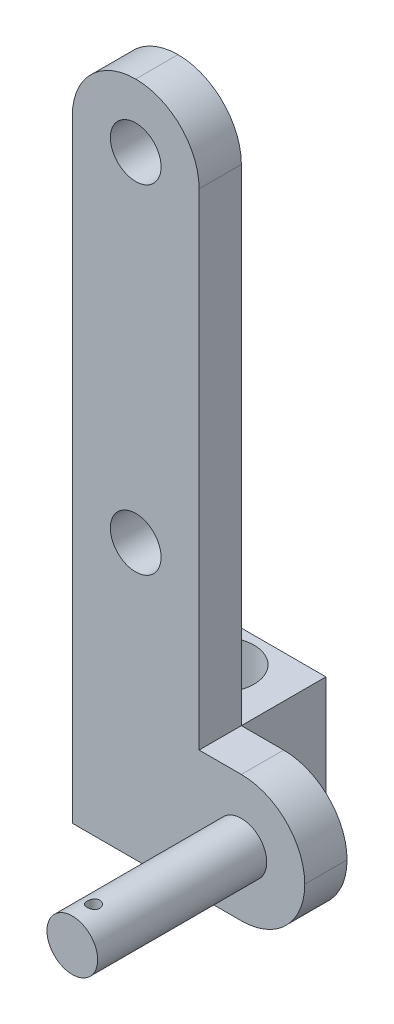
ISO-10303-21;
HEADER;
FILE_DESCRIPTION(('STEP AP214'),'2;1');
FILE_NAME('part.step','',(''),(''),'','','');
FILE_SCHEMA(('AUTOMOTIVE_DESIGN { 1 0 10303 214 1 1 1 1 }'));
ENDSEC;
DATA;
#1=APPLICATION_CONTEXT('core data for automotive mechanical design processes');
#2=APPLICATION_PROTOCOL_DEFINITION('international standard','automotive_design',2000,#1);
#3=PRODUCT_CONTEXT('',#1,'mechanical');
#4=PRODUCT('Part','Part','',(#3));
#5=PRODUCT_RELATED_PRODUCT_CATEGORY('part','',(#4));
#6=PRODUCT_DEFINITION_FORMATION('','',#4);
#7=PRODUCT_DEFINITION_CONTEXT('part definition',#1,'design');
#8=PRODUCT_DEFINITION('design','',#6,#7);
#9=PRODUCT_DEFINITION_SHAPE('','',#8);
#10=(LENGTH_UNIT() NAMED_UNIT(*) SI_UNIT(.MILLI.,.METRE.));
#11=(NAMED_UNIT(*) PLANE_ANGLE_UNIT() SI_UNIT($,.RADIAN.));
#12=(NAMED_UNIT(*) SI_UNIT($,.STERADIAN.) SOLID_ANGLE_UNIT());
#13=UNCERTAINTY_MEASURE_WITH_UNIT(LENGTH_MEASURE(1.E-05),#10,'distance_accuracy_value','');
#14=(GEOMETRIC_REPRESENTATION_CONTEXT(3) GLOBAL_UNCERTAINTY_ASSIGNED_CONTEXT((#13)) GLOBAL_UNIT_ASSIGNED_CONTEXT((#10,
#11,#12)) REPRESENTATION_CONTEXT('',''));
#15=CARTESIAN_POINT('',(0.,0.,0.));
#16=DIRECTION('',(0.,0.,1.));
#17=DIRECTION('',(1.,0.,0.));
#18=AXIS2_PLACEMENT_3D('',#15,#16,#17);
#19=CARTESIAN_POINT('',(-30.,0.,0.));
#20=DIRECTION('',(0.,0.,-1.));
#21=DIRECTION('',(-1.,0.,0.));
#22=AXIS2_PLACEMENT_3D('',#19,#20,#21);
#23=PLANE('',#22);
#24=CARTESIAN_POINT('',(-15.,-95.,0.));
#25=DIRECTION('',(0.,0.,-1.));
#26=DIRECTION('',(-1.,0.,0.));
#27=AXIS2_PLACEMENT_3D('',#24,#25,#26);
#28=CIRCLE('',#27,6.);
#29=CARTESIAN_POINT('',(-21.,-95.,0.));
#30=VERTEX_POINT('',#29);
#31=EDGE_CURVE('E326',#30,#30,#28,.T.);
#32=ORIENTED_EDGE('',*,*,#31,.F.);
#33=EDGE_LOOP('',(#32));
#34=FACE_BOUND('',#33,.T.);
#35=CARTESIAN_POINT('',(-15.,-15.,0.));
#36=DIRECTION('',(0.,0.,-1.));
#37=DIRECTION('',(-1.,0.,0.));
#38=AXIS2_PLACEMENT_3D('',#35,#36,#37);
#39=CIRCLE('',#38,6.);
#40=CARTESIAN_POINT('',(-21.,-15.,0.));
#41=VERTEX_POINT('',#40);
#42=EDGE_CURVE('E320',#41,#41,#39,.T.);
#43=ORIENTED_EDGE('',*,*,#42,.F.);
#44=EDGE_LOOP('',(#43));
#45=FACE_BOUND('',#44,.T.);
#46=DIRECTION('',(0.,-1.,0.));
#47=VECTOR('',#46,1.);
#48=CARTESIAN_POINT('',(-30.,0.,0.));
#49=LINE('',#48,#47);
#50=CARTESIAN_POINT('',(-30.,-15.,0.));
#51=VERTEX_POINT('',#50);
#52=CARTESIAN_POINT('',(-30.,-130.,0.));
#53=VERTEX_POINT('',#52);
#54=EDGE_CURVE('E146',#51,#53,#49,.T.);
#55=ORIENTED_EDGE('',*,*,#54,.F.);
#56=CARTESIAN_POINT('',(-15.,-15.,0.));
#57=DIRECTION('',(0.,0.,-1.));
#58=DIRECTION('',(-1.,0.,0.));
#59=AXIS2_PLACEMENT_3D('',#56,#57,#58);
#60=CIRCLE('',#59,15.);
#61=CARTESIAN_POINT('',(-15.,0.,0.));
#62=VERTEX_POINT('',#61);
#63=EDGE_CURVE('E46',#51,#62,#60,.T.);
#64=ORIENTED_EDGE('',*,*,#63,.T.);
#65=CARTESIAN_POINT('',(-15.,-15.,0.));
#66=DIRECTION('',(0.,0.,-1.));
#67=DIRECTION('',(-1.,0.,0.));
#68=AXIS2_PLACEMENT_3D('',#65,#66,#67);
#69=CIRCLE('',#68,15.);
#70=CARTESIAN_POINT('',(0.,-15.,0.));
#71=VERTEX_POINT('',#70);
#72=EDGE_CURVE('E54',#62,#71,#69,.T.);
#73=ORIENTED_EDGE('',*,*,#72,.T.);
#74=DIRECTION('',(0.,1.,0.));
#75=VECTOR('',#74,1.);
#76=CARTESIAN_POINT('',(0.,0.,0.));
#77=LINE('',#76,#75);
#78=CARTESIAN_POINT('',(0.,-130.,0.));
#79=VERTEX_POINT('',#78);
#80=EDGE_CURVE('E157',#79,#71,#77,.T.);
#81=ORIENTED_EDGE('',*,*,#80,.F.);
#82=DIRECTION('',(1.,0.,0.));
#83=VECTOR('',#82,1.);
#84=CARTESIAN_POINT('',(-30.,-130.,0.));
#85=LINE('',#84,#83);
#86=EDGE_CURVE('E142',#53,#79,#85,.T.);
#87=ORIENTED_EDGE('',*,*,#86,.F.);
#88=EDGE_LOOP('',(#55,#64,#73,#81,#87));
#89=FACE_BOUND('',#88,.T.);
#90=ADVANCED_FACE('F33',(#34,#45,#89),#23,.T.);
#91=CARTESIAN_POINT('',(-30.,0.,10.));
#92=DIRECTION('',(0.,0.,-1.));
#93=DIRECTION('',(-1.,0.,0.));
#94=AXIS2_PLACEMENT_3D('',#91,#92,#93);
#95=PLANE('',#94);
#96=CARTESIAN_POINT('',(-15.,-95.,10.));
#97=DIRECTION('',(0.,0.,1.));
#98=DIRECTION('',(1.,0.,0.));
#99=AXIS2_PLACEMENT_3D('',#96,#97,#98);
#100=CIRCLE('',#99,6.);
#101=CARTESIAN_POINT('',(-8.99999999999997,-95.,10.));
#102=VERTEX_POINT('',#101);
#103=EDGE_CURVE('E184',#102,#102,#100,.T.);
#104=ORIENTED_EDGE('',*,*,#103,.F.);
#105=EDGE_LOOP('',(#104));
#106=FACE_BOUND('',#105,.T.);
#107=CARTESIAN_POINT('',(-15.,-15.,10.));
#108=DIRECTION('',(0.,0.,1.));
#109=DIRECTION('',(1.,0.,0.));
#110=AXIS2_PLACEMENT_3D('',#107,#108,#109);
#111=CIRCLE('',#110,6.);
#112=CARTESIAN_POINT('',(-8.99999999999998,-15.,10.));
#113=VERTEX_POINT('',#112);
#114=EDGE_CURVE('E323',#113,#113,#111,.T.);
#115=ORIENTED_EDGE('',*,*,#114,.F.);
#116=EDGE_LOOP('',(#115));
#117=FACE_BOUND('',#116,.T.);
#118=DIRECTION('',(1.,0.,0.));
#119=VECTOR('',#118,1.);
#120=CARTESIAN_POINT('',(25.,-160.,10.));
#121=LINE('',#120,#119);
#122=CARTESIAN_POINT('',(-30.,-160.,10.));
#123=VERTEX_POINT('',#122);
#124=CARTESIAN_POINT('',(10.,-160.,10.));
#125=VERTEX_POINT('',#124);
#126=EDGE_CURVE('E156',#123,#125,#121,.T.);
#127=ORIENTED_EDGE('',*,*,#126,.T.);
#128=CARTESIAN_POINT('',(10.,-145.,10.));
#129=DIRECTION('',(0.,0.,-1.));
#130=DIRECTION('',(-1.,0.,0.));
#131=AXIS2_PLACEMENT_3D('',#128,#129,#130);
#132=CIRCLE('',#131,15.);
#133=CARTESIAN_POINT('',(25.,-145.,10.));
#134=VERTEX_POINT('',#133);
#135=EDGE_CURVE('E277',#125,#134,#132,.F.);
#136=ORIENTED_EDGE('',*,*,#135,.T.);
#137=CARTESIAN_POINT('',(10.,-145.,10.));
#138=DIRECTION('',(0.,0.,-1.));
#139=DIRECTION('',(-1.,0.,0.));
#140=AXIS2_PLACEMENT_3D('',#137,#138,#139);
#141=CIRCLE('',#140,15.);
#142=CARTESIAN_POINT('',(10.,-130.,10.));
#143=VERTEX_POINT('',#142);
#144=EDGE_CURVE('E263',#134,#143,#141,.F.);
#145=ORIENTED_EDGE('',*,*,#144,.T.);
#146=DIRECTION('',(-1.,0.,0.));
#147=VECTOR('',#146,1.);
#148=CARTESIAN_POINT('',(0.,-130.,10.));
#149=LINE('',#148,#147);
#150=CARTESIAN_POINT('',(0.,-130.,10.));
#151=VERTEX_POINT('',#150);
#152=EDGE_CURVE('E160',#143,#151,#149,.T.);
#153=ORIENTED_EDGE('',*,*,#152,.T.);
#154=DIRECTION('',(0.,1.,0.));
#155=VECTOR('',#154,1.);
#156=CARTESIAN_POINT('',(0.,0.,10.));
#157=LINE('',#156,#155);
#158=CARTESIAN_POINT('',(0.,-15.,10.));
#159=VERTEX_POINT('',#158);
#160=EDGE_CURVE('E162',#151,#159,#157,.T.);
#161=ORIENTED_EDGE('',*,*,#160,.T.);
#162=CARTESIAN_POINT('',(-15.,-15.,10.));
#163=DIRECTION('',(0.,0.,-1.));
#164=DIRECTION('',(-1.,0.,0.));
#165=AXIS2_PLACEMENT_3D('',#162,#163,#164);
#166=CIRCLE('',#165,15.);
#167=CARTESIAN_POINT('',(-15.,0.,10.));
#168=VERTEX_POINT('',#167);
#169=EDGE_CURVE('E270',#159,#168,#166,.F.);
#170=ORIENTED_EDGE('',*,*,#169,.T.);
#171=CARTESIAN_POINT('',(-15.,-15.,10.));
#172=DIRECTION('',(0.,0.,-1.));
#173=DIRECTION('',(-1.,0.,0.));
#174=AXIS2_PLACEMENT_3D('',#171,#172,#173);
#175=CIRCLE('',#174,15.);
#176=CARTESIAN_POINT('',(-30.,-15.,10.));
#177=VERTEX_POINT('',#176);
#178=EDGE_CURVE('E275',#168,#177,#175,.F.);
#179=ORIENTED_EDGE('',*,*,#178,.T.);
#180=DIRECTION('',(0.,-1.,0.));
#181=VECTOR('',#180,1.);
#182=CARTESIAN_POINT('',(-30.,0.,10.));
#183=LINE('',#182,#181);
#184=EDGE_CURVE('E154',#177,#123,#183,.T.);
#185=ORIENTED_EDGE('',*,*,#184,.T.);
#186=EDGE_LOOP('',(#127,#136,#145,#153,#161,#170,#179,#185));
#187=FACE_BOUND('',#186,.T.);
#188=CARTESIAN_POINT('',(10.,-145.,10.));
#189=DIRECTION('',(0.,0.,-1.));
#190=DIRECTION('',(-1.,0.,0.));
#191=AXIS2_PLACEMENT_3D('',#188,#189,#190);
#192=CIRCLE('',#191,6.);
#193=CARTESIAN_POINT('',(4.00000000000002,-145.,10.));
#194=VERTEX_POINT('',#193);
#195=EDGE_CURVE('E260',#194,#194,#192,.F.);
#196=ORIENTED_EDGE('',*,*,#195,.F.);
#197=EDGE_LOOP('',(#196));
#198=FACE_BOUND('',#197,.T.);
#199=ADVANCED_FACE('F230',(#106,#117,#187,#198),#95,.F.);
#200=CARTESIAN_POINT('',(-30.,0.,10.));
#201=DIRECTION('',(1.,0.,0.));
#202=DIRECTION('',(0.,1.,0.));
#203=AXIS2_PLACEMENT_3D('',#200,#201,#202);
#204=PLANE('',#203);
#205=ORIENTED_EDGE('',*,*,#184,.F.);
#206=DIRECTION('',(0.,0.,-1.));
#207=VECTOR('',#206,1.);
#208=CARTESIAN_POINT('',(-30.,-15.,10.));
#209=LINE('',#208,#207);
#210=EDGE_CURVE('E176',#177,#51,#209,.T.);
#211=ORIENTED_EDGE('',*,*,#210,.T.);
#212=ORIENTED_EDGE('',*,*,#54,.T.);
#213=DIRECTION('',(0.,0.,1.));
#214=VECTOR('',#213,1.);
#215=CARTESIAN_POINT('',(-30.,-130.,-20.));
#216=LINE('',#215,#214);
#217=CARTESIAN_POINT('',(-30.,-130.,-20.));
#218=VERTEX_POINT('',#217);
#219=EDGE_CURVE('E148',#218,#53,#216,.T.);
#220=ORIENTED_EDGE('',*,*,#219,.F.);
#221=DIRECTION('',(0.,1.,0.));
#222=VECTOR('',#221,1.);
#223=CARTESIAN_POINT('',(-30.,-160.,-20.));
#224=LINE('',#223,#222);
#225=CARTESIAN_POINT('',(-30.,-160.,-20.));
#226=VERTEX_POINT('',#225);
#227=EDGE_CURVE('E134',#226,#218,#224,.T.);
#228=ORIENTED_EDGE('',*,*,#227,.F.);
#229=DIRECTION('',(0.,0.,-1.));
#230=VECTOR('',#229,1.);
#231=CARTESIAN_POINT('',(-30.,-160.,10.));
#232=LINE('',#231,#230);
#233=EDGE_CURVE('E296',#123,#226,#232,.T.);
#234=ORIENTED_EDGE('',*,*,#233,.F.);
#235=EDGE_LOOP('',(#205,#211,#212,#220,#228,#234));
#236=FACE_BOUND('',#235,.T.);
#237=ADVANCED_FACE('F236',(#236),#204,.F.);
#238=CARTESIAN_POINT('',(25.,-160.,10.));
#239=DIRECTION('',(0.,1.,0.));
#240=DIRECTION('',(0.,0.,1.));
#241=AXIS2_PLACEMENT_3D('',#238,#239,#240);
#242=PLANE('',#241);
#243=CARTESIAN_POINT('',(-15.,-160.,-10.));
#244=DIRECTION('',(0.,1.,0.));
#245=DIRECTION('',(0.,0.,1.));
#246=AXIS2_PLACEMENT_3D('',#243,#244,#245);
#247=CIRCLE('',#246,8.);
#248=CARTESIAN_POINT('',(-15.,-160.,-2.));
#249=VERTEX_POINT('',#248);
#250=EDGE_CURVE('E309',#249,#249,#247,.T.);
#251=ORIENTED_EDGE('',*,*,#250,.T.);
#252=EDGE_LOOP('',(#251));
#253=FACE_BOUND('',#252,.T.);
#254=DIRECTION('',(1.,0.,0.));
#255=VECTOR('',#254,1.);
#256=CARTESIAN_POINT('',(25.,-160.,0.));
#257=LINE('',#256,#255);
#258=CARTESIAN_POINT('',(0.,-160.,0.));
#259=VERTEX_POINT('',#258);
#260=CARTESIAN_POINT('',(10.,-160.,0.));
#261=VERTEX_POINT('',#260);
#262=EDGE_CURVE('E173',#259,#261,#257,.T.);
#263=ORIENTED_EDGE('',*,*,#262,.T.);
#264=DIRECTION('',(0.,0.,-1.));
#265=VECTOR('',#264,1.);
#266=CARTESIAN_POINT('',(10.,-160.,10.));
#267=LINE('',#266,#265);
#268=EDGE_CURVE('E268',#261,#125,#267,.F.);
#269=ORIENTED_EDGE('',*,*,#268,.T.);
#270=ORIENTED_EDGE('',*,*,#126,.F.);
#271=ORIENTED_EDGE('',*,*,#233,.T.);
#272=DIRECTION('',(-1.,0.,0.));
#273=VECTOR('',#272,1.);
#274=CARTESIAN_POINT('',(0.,-160.,-20.));
#275=LINE('',#274,#273);
#276=CARTESIAN_POINT('',(0.,-160.,-20.));
#277=VERTEX_POINT('',#276);
#278=EDGE_CURVE('E128',#277,#226,#275,.T.);
#279=ORIENTED_EDGE('',*,*,#278,.F.);
#280=DIRECTION('',(0.,0.,1.));
#281=VECTOR('',#280,1.);
#282=CARTESIAN_POINT('',(0.,-160.,-20.));
#283=LINE('',#282,#281);
#284=EDGE_CURVE('E124',#277,#259,#283,.T.);
#285=ORIENTED_EDGE('',*,*,#284,.T.);
#286=EDGE_LOOP('',(#263,#269,#270,#271,#279,#285));
#287=FACE_BOUND('',#286,.T.);
#288=ADVANCED_FACE('F340',(#253,#287),#242,.F.);
#289=CARTESIAN_POINT('',(0.,-130.,10.));
#290=DIRECTION('',(0.,-1.,0.));
#291=DIRECTION('',(0.,0.,-1.));
#292=AXIS2_PLACEMENT_3D('',#289,#290,#291);
#293=PLANE('',#292);
#294=ORIENTED_EDGE('',*,*,#152,.F.);
#295=DIRECTION('',(0.,0.,-1.));
#296=VECTOR('',#295,1.);
#297=CARTESIAN_POINT('',(10.,-130.,10.));
#298=LINE('',#297,#296);
#299=CARTESIAN_POINT('',(10.,-130.,0.));
#300=VERTEX_POINT('',#299);
#301=EDGE_CURVE('E174',#143,#300,#298,.T.);
#302=ORIENTED_EDGE('',*,*,#301,.T.);
#303=DIRECTION('',(-1.,0.,0.));
#304=VECTOR('',#303,1.);
#305=CARTESIAN_POINT('',(0.,-130.,0.));
#306=LINE('',#305,#304);
#307=EDGE_CURVE('E257',#300,#79,#306,.T.);
#308=ORIENTED_EDGE('',*,*,#307,.T.);
#309=DIRECTION('',(0.,0.,-1.));
#310=VECTOR('',#309,1.);
#311=CARTESIAN_POINT('',(0.,-130.,10.));
#312=LINE('',#311,#310);
#313=EDGE_CURVE('E165',#151,#79,#312,.T.);
#314=ORIENTED_EDGE('',*,*,#313,.F.);
#315=EDGE_LOOP('',(#294,#302,#308,#314));
#316=FACE_BOUND('',#315,.T.);
#317=ADVANCED_FACE('F247',(#316),#293,.F.);
#318=CARTESIAN_POINT('',(0.,0.,10.));
#319=DIRECTION('',(-1.,0.,0.));
#320=DIRECTION('',(0.,-1.,0.));
#321=AXIS2_PLACEMENT_3D('',#318,#319,#320);
#322=PLANE('',#321);
#323=ORIENTED_EDGE('',*,*,#80,.T.);
#324=DIRECTION('',(0.,0.,-1.));
#325=VECTOR('',#324,1.);
#326=CARTESIAN_POINT('',(0.,-15.,10.));
#327=LINE('',#326,#325);
#328=EDGE_CURVE('E11',#71,#159,#327,.F.);
#329=ORIENTED_EDGE('',*,*,#328,.T.);
#330=ORIENTED_EDGE('',*,*,#160,.F.);
#331=ORIENTED_EDGE('',*,*,#313,.T.);
#332=EDGE_LOOP('',(#323,#329,#330,#331));
#333=FACE_BOUND('',#332,.T.);
#334=ADVANCED_FACE('F242',(#333),#322,.F.);
#335=CARTESIAN_POINT('',(10.,-145.,0.));
#336=DIRECTION('',(0.,0.,-1.));
#337=DIRECTION('',(-1.,0.,0.));
#338=AXIS2_PLACEMENT_3D('',#335,#336,#337);
#339=CIRCLE('',#338,15.);
#340=CARTESIAN_POINT('',(25.,-145.,0.));
#341=VERTEX_POINT('',#340);
#342=EDGE_CURVE('E251',#300,#341,#339,.T.);
#343=ORIENTED_EDGE('',*,*,#342,.T.);
#344=CARTESIAN_POINT('',(10.,-145.,0.));
#345=DIRECTION('',(0.,0.,-1.));
#346=DIRECTION('',(-1.,0.,0.));
#347=AXIS2_PLACEMENT_3D('',#344,#345,#346);
#348=CIRCLE('',#347,15.);
#349=EDGE_CURVE('E254',#341,#261,#348,.T.);
#350=ORIENTED_EDGE('',*,*,#349,.T.);
#351=ORIENTED_EDGE('',*,*,#262,.F.);
#352=DIRECTION('',(0.,-1.,0.));
#353=VECTOR('',#352,1.);
#354=CARTESIAN_POINT('',(0.,-130.,0.));
#355=LINE('',#354,#353);
#356=EDGE_CURVE('E138',#79,#259,#355,.T.);
#357=ORIENTED_EDGE('',*,*,#356,.F.);
#358=ORIENTED_EDGE('',*,*,#307,.F.);
#359=EDGE_LOOP('',(#343,#350,#351,#357,#358));
#360=FACE_BOUND('',#359,.T.);
#361=ADVANCED_FACE('F227',(#360),#23,.T.);
#362=CARTESIAN_POINT('',(10.,-145.,50.));
#363=DIRECTION('',(0.,0.,-1.));
#364=DIRECTION('',(-1.,0.,0.));
#365=AXIS2_PLACEMENT_3D('',#362,#363,#364);
#366=CYLINDRICAL_SURFACE('',#365,6.);
#367=CARTESIAN_POINT('',(10.,-151.,46.5));
#368=CARTESIAN_POINT('',(10.0828760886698,-150.99999859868,46.4999976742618));
#369=CARTESIAN_POINT('',(10.1657781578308,-150.998265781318,46.4931084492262));
#370=CARTESIAN_POINT('',(10.3292063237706,-150.991521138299,46.465774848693));
#371=CARTESIAN_POINT('',(10.4097310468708,-150.9865074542,46.4453227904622));
#372=CARTESIAN_POINT('',(10.5660208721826,-150.97375626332,46.3915607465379));
#373=CARTESIAN_POINT('',(10.64179156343,-150.966022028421,46.3582662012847));
#374=CARTESIAN_POINT('',(10.7866721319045,-150.948653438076,46.2798186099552));
#375=CARTESIAN_POINT('',(10.8557817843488,-150.939019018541,46.2346651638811));
#376=CARTESIAN_POINT('',(10.9868019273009,-150.918674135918,46.1327992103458));
#377=CARTESIAN_POINT('',(11.0485556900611,-150.907947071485,46.0758884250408));
#378=CARTESIAN_POINT('',(11.1617489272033,-150.886736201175,45.9525477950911));
#379=CARTESIAN_POINT('',(11.2131872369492,-150.876252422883,45.8861168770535));
#380=CARTESIAN_POINT('',(11.3050265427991,-150.856547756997,45.7444047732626));
#381=CARTESIAN_POINT('',(11.3452522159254,-150.847347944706,45.6690067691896));
#382=CARTESIAN_POINT('',(11.4123969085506,-150.831494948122,45.5122515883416));
#383=CARTESIAN_POINT('',(11.4393180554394,-150.824841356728,45.4308953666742));
#384=CARTESIAN_POINT('',(11.4785548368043,-150.815004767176,45.2662565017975));
#385=CARTESIAN_POINT('',(11.4911522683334,-150.811754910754,45.1830451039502));
#386=CARTESIAN_POINT('',(11.5022617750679,-150.808893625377,45.015631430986));
#387=CARTESIAN_POINT('',(11.500776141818,-150.809281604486,44.9314293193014));
#388=CARTESIAN_POINT('',(11.4839865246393,-150.813592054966,44.7665841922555));
#389=CARTESIAN_POINT('',(11.4690183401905,-150.817428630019,44.6859043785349));
#390=CARTESIAN_POINT('',(11.4262241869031,-150.828067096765,44.5282389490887));
#391=CARTESIAN_POINT('',(11.3983973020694,-150.834869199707,44.451253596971));
#392=CARTESIAN_POINT('',(11.3303894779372,-150.850751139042,44.3022619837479));
#393=CARTESIAN_POINT('',(11.2900866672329,-150.859853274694,44.2303138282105));
#394=CARTESIAN_POINT('',(11.198356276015,-150.879297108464,44.0940812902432));
#395=CARTESIAN_POINT('',(11.1469267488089,-150.889639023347,44.0297982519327));
#396=CARTESIAN_POINT('',(11.0326634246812,-150.910758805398,43.9087963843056));
#397=CARTESIAN_POINT('',(10.9695462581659,-150.92154069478,43.8523455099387));
#398=CARTESIAN_POINT('',(10.8346119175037,-150.942059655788,43.7507787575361));
#399=CARTESIAN_POINT('',(10.762794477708,-150.951796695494,43.7056632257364));
#400=CARTESIAN_POINT('',(10.6121158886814,-150.969177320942,43.6279494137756));
#401=CARTESIAN_POINT('',(10.5332313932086,-150.976813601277,43.5953946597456));
#402=CARTESIAN_POINT('',(10.3708760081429,-150.989079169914,43.5440826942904));
#403=CARTESIAN_POINT('',(10.2874059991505,-150.993709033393,43.5253228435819));
#404=CARTESIAN_POINT('',(10.12053997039,-150.999354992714,43.5025424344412));
#405=CARTESIAN_POINT('',(10.0371967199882,-151.000460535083,43.4981569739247));
#406=CARTESIAN_POINT('',(9.87096712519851,-150.999188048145,43.5032490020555));
#407=CARTESIAN_POINT('',(9.78808074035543,-150.996810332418,43.5127252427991));
#408=CARTESIAN_POINT('',(9.62638573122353,-150.988895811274,43.5449709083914));
#409=CARTESIAN_POINT('',(9.54753488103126,-150.983406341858,43.567541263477));
#410=CARTESIAN_POINT('',(9.39474270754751,-150.969887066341,43.6251070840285));
#411=CARTESIAN_POINT('',(9.32080188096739,-150.961857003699,43.6601038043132));
#412=CARTESIAN_POINT('',(9.17847686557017,-150.943933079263,43.7422361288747));
#413=CARTESIAN_POINT('',(9.11021455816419,-150.934008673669,43.7895761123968));
#414=CARTESIAN_POINT('',(8.98247338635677,-150.913445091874,43.894789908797));
#415=CARTESIAN_POINT('',(8.92299604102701,-150.902805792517,43.9526655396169));
#416=CARTESIAN_POINT('',(8.81300943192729,-150.881689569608,44.0790019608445));
#417=CARTESIAN_POINT('',(8.76275613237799,-150.871223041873,44.1476877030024));
#418=CARTESIAN_POINT('',(8.67448924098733,-150.851928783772,44.2927326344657));
#419=CARTESIAN_POINT('',(8.63647510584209,-150.84310098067,44.3690914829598));
#420=CARTESIAN_POINT('',(8.57404857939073,-150.828180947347,44.5269057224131));
#421=CARTESIAN_POINT('',(8.54955560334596,-150.822072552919,44.608327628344));
#422=CARTESIAN_POINT('',(8.51465434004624,-150.813267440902,44.7743096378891));
#423=CARTESIAN_POINT('',(8.50424297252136,-150.810569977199,44.8588690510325));
#424=CARTESIAN_POINT('',(8.49796140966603,-150.80894901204,45.0261210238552));
#425=CARTESIAN_POINT('',(8.5016821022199,-150.809919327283,45.1087974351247));
#426=CARTESIAN_POINT('',(8.52262272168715,-150.815279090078,45.272303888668));
#427=CARTESIAN_POINT('',(8.53984237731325,-150.819668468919,45.3531339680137));
#428=CARTESIAN_POINT('',(8.58706868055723,-150.831312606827,45.5102084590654));
#429=CARTESIAN_POINT('',(8.61699859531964,-150.838550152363,45.5864773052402));
#430=CARTESIAN_POINT('',(8.68873508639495,-150.855077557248,45.7329653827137));
#431=CARTESIAN_POINT('',(8.73054330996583,-150.864367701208,45.8031837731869));
#432=CARTESIAN_POINT('',(8.82613225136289,-150.884256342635,45.937554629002));
#433=CARTESIAN_POINT('',(8.88019683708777,-150.894882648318,46.001501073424));
#434=CARTESIAN_POINT('',(8.99821062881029,-150.916080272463,46.1195470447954));
#435=CARTESIAN_POINT('',(9.06216217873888,-150.926651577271,46.173644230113));
#436=CARTESIAN_POINT('',(9.19953241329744,-150.946776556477,46.2714113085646));
#437=CARTESIAN_POINT('',(9.27310157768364,-150.956308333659,46.3148746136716));
#438=CARTESIAN_POINT('',(9.42673394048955,-150.973049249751,46.3887474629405));
#439=CARTESIAN_POINT('',(9.50679243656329,-150.980260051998,46.4191663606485));
#440=CARTESIAN_POINT('',(9.65558974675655,-150.990480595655,46.4615718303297));
#441=CARTESIAN_POINT('',(9.72361982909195,-150.994025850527,46.4759512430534));
#442=CARTESIAN_POINT('',(9.86109392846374,-150.99878605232,46.4951659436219));
#443=CARTESIAN_POINT('',(9.93053783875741,-151.000001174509,46.5000019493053));
#444=CARTESIAN_POINT('',(10.,-151.,46.5));
#445=B_SPLINE_CURVE_WITH_KNOTS('',3,(#367,#368,#369,#370,#371,#372,#373,#374,#375,#376,#377,
#378,#379,#380,#381,#382,#383,#384,#385,#386,#387,#388,#389,#390,#391,#392,#393,#394,#395,#396,
#397,#398,#399,#400,#401,#402,#403,#404,#405,#406,#407,#408,#409,#410,#411,#412,#413,#414,#415,
#416,#417,#418,#419,#420,#421,#422,#423,#424,#425,#426,#427,#428,#429,#430,#431,#432,#433,#434,
#435,#436,#437,#438,#439,#440,#441,#442,#443,#444),.UNSPECIFIED.,.T.,.F.,(4,2,2,2,2,2,2,2,2,2,2,
2,2,2,2,2,2,2,2,2,2,2,2,2,2,2,2,2,2,2,2,2,2,2,2,2,2,2,4),(0.,0.24837371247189,0.496888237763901,
0.745104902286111,0.993329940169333,1.2461443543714,1.49898729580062,1.75558647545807,
2.01214461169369,2.26356295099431,2.51494038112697,2.76022497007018,3.00552703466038,
3.25330527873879,3.50112690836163,3.7560150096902,4.01091089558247,4.26668229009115,
4.52240473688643,4.77158308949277,5.02073901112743,5.26620274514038,5.51169127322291,
5.76153587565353,6.01142363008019,6.26744509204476,6.52345518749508,6.77792254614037,
7.03233423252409,7.27943780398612,7.52653640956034,7.77216400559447,8.01782568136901,
8.2698957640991,8.52202569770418,8.77872185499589,9.0352336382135,9.24342242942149,
9.4515955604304),.UNSPECIFIED.);
#446=CARTESIAN_POINT('',(10.,-151.,46.5));
#447=VERTEX_POINT('',#446);
#448=EDGE_CURVE('E37',#447,#447,#445,.T.);
#449=ORIENTED_EDGE('',*,*,#448,.T.);
#450=EDGE_LOOP('',(#449));
#451=FACE_BOUND('',#450,.T.);
#452=CARTESIAN_POINT('',(10.,-139.,46.5));
#453=CARTESIAN_POINT('',(9.91712391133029,-139.00000140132,46.4999976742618));
#454=CARTESIAN_POINT('',(9.83422184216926,-139.001734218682,46.4931084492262));
#455=CARTESIAN_POINT('',(9.67079367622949,-139.008478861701,46.465774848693));
#456=CARTESIAN_POINT('',(9.59026895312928,-139.0134925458,46.4453227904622));
#457=CARTESIAN_POINT('',(9.43397912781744,-139.02624373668,46.3915607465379));
#458=CARTESIAN_POINT('',(9.35820843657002,-139.033977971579,46.3582662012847));
#459=CARTESIAN_POINT('',(9.21332786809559,-139.051346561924,46.2798186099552));
#460=CARTESIAN_POINT('',(9.14421821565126,-139.06098098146,46.2346651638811));
#461=CARTESIAN_POINT('',(9.0131980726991,-139.081325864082,46.1327992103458));
#462=CARTESIAN_POINT('',(8.95144430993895,-139.092052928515,46.0758884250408));
#463=CARTESIAN_POINT('',(8.83825107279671,-139.113263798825,45.9525477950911));
#464=CARTESIAN_POINT('',(8.78681276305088,-139.123747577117,45.8861168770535));
#465=CARTESIAN_POINT('',(8.69497345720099,-139.143452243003,45.7444047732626));
#466=CARTESIAN_POINT('',(8.65474778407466,-139.152652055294,45.6690067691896));
#467=CARTESIAN_POINT('',(8.58760309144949,-139.168505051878,45.5122515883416));
#468=CARTESIAN_POINT('',(8.56068194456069,-139.175158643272,45.4308953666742));
#469=CARTESIAN_POINT('',(8.52144516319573,-139.184995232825,45.2662565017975));
#470=CARTESIAN_POINT('',(8.50884773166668,-139.188245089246,45.1830451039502));
#471=CARTESIAN_POINT('',(8.49773822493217,-139.191106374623,45.015631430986));
#472=CARTESIAN_POINT('',(8.49922385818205,-139.190718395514,44.9314293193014));
#473=CARTESIAN_POINT('',(8.51601347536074,-139.186407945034,44.7665841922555));
#474=CARTESIAN_POINT('',(8.5309816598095,-139.182571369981,44.6859043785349));
#475=CARTESIAN_POINT('',(8.57377581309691,-139.171932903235,44.5282389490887));
#476=CARTESIAN_POINT('',(8.6016026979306,-139.165130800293,44.451253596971));
#477=CARTESIAN_POINT('',(8.66961052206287,-139.149248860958,44.3022619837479));
#478=CARTESIAN_POINT('',(8.70991333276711,-139.140146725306,44.2303138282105));
#479=CARTESIAN_POINT('',(8.80164372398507,-139.120702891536,44.0940812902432));
#480=CARTESIAN_POINT('',(8.85307325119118,-139.110360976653,44.0297982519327));
#481=CARTESIAN_POINT('',(8.96733657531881,-139.089241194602,43.9087963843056));
#482=CARTESIAN_POINT('',(9.03045374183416,-139.07845930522,43.8523455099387));
#483=CARTESIAN_POINT('',(9.16538808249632,-139.057940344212,43.7507787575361));
#484=CARTESIAN_POINT('',(9.23720552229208,-139.048203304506,43.7056632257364));
#485=CARTESIAN_POINT('',(9.38788411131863,-139.030822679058,43.6279494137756));
#486=CARTESIAN_POINT('',(9.4667686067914,-139.023186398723,43.5953946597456));
#487=CARTESIAN_POINT('',(9.62912399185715,-139.010920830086,43.5440826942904));
#488=CARTESIAN_POINT('',(9.71259400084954,-139.006290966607,43.5253228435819));
#489=CARTESIAN_POINT('',(9.87946002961,-139.000645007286,43.5025424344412));
#490=CARTESIAN_POINT('',(9.96280328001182,-138.999539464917,43.4981569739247));
#491=CARTESIAN_POINT('',(10.1290328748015,-139.000811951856,43.5032490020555));
#492=CARTESIAN_POINT('',(10.2119192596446,-139.003189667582,43.5127252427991));
#493=CARTESIAN_POINT('',(10.3736142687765,-139.011104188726,43.5449709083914));
#494=CARTESIAN_POINT('',(10.4524651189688,-139.016593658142,43.567541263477));
#495=CARTESIAN_POINT('',(10.6052572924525,-139.030112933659,43.6251070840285));
#496=CARTESIAN_POINT('',(10.6791981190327,-139.038142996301,43.6601038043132));
#497=CARTESIAN_POINT('',(10.8215231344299,-139.056066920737,43.7422361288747));
#498=CARTESIAN_POINT('',(10.8897854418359,-139.065991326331,43.7895761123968));
#499=CARTESIAN_POINT('',(11.0175266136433,-139.086554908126,43.894789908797));
#500=CARTESIAN_POINT('',(11.077003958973,-139.097194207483,43.9526655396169));
#501=CARTESIAN_POINT('',(11.1869905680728,-139.118310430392,44.0790019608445));
#502=CARTESIAN_POINT('',(11.2372438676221,-139.128776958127,44.1476877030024));
#503=CARTESIAN_POINT('',(11.3255107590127,-139.148071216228,44.2927326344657));
#504=CARTESIAN_POINT('',(11.363524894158,-139.15689901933,44.3690914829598));
#505=CARTESIAN_POINT('',(11.4259514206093,-139.171819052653,44.5269057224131));
#506=CARTESIAN_POINT('',(11.4504443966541,-139.177927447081,44.608327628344));
#507=CARTESIAN_POINT('',(11.4853456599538,-139.186732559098,44.7743096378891));
#508=CARTESIAN_POINT('',(11.4957570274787,-139.189430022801,44.8588690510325));
#509=CARTESIAN_POINT('',(11.502038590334,-139.19105098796,45.0261210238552));
#510=CARTESIAN_POINT('',(11.4983178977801,-139.190080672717,45.1087974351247));
#511=CARTESIAN_POINT('',(11.4773772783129,-139.184720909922,45.272303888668));
#512=CARTESIAN_POINT('',(11.4601576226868,-139.180331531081,45.3531339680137));
#513=CARTESIAN_POINT('',(11.4129313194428,-139.168687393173,45.5102084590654));
#514=CARTESIAN_POINT('',(11.3830014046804,-139.161449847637,45.5864773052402));
#515=CARTESIAN_POINT('',(11.3112649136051,-139.144922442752,45.7329653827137));
#516=CARTESIAN_POINT('',(11.2694566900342,-139.135632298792,45.8031837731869));
#517=CARTESIAN_POINT('',(11.1738677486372,-139.115743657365,45.937554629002));
#518=CARTESIAN_POINT('',(11.1198031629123,-139.105117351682,46.001501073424));
#519=CARTESIAN_POINT('',(11.0017893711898,-139.083919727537,46.1195470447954));
#520=CARTESIAN_POINT('',(10.9378378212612,-139.073348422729,46.173644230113));
#521=CARTESIAN_POINT('',(10.8004675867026,-139.053223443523,46.2714113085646));
#522=CARTESIAN_POINT('',(10.7268984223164,-139.043691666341,46.3148746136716));
#523=CARTESIAN_POINT('',(10.5732660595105,-139.026950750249,46.3887474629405));
#524=CARTESIAN_POINT('',(10.4932075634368,-139.019739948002,46.4191663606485));
#525=CARTESIAN_POINT('',(10.3444102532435,-139.009519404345,46.4615718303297));
#526=CARTESIAN_POINT('',(10.2763801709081,-139.005974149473,46.4759512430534));
#527=CARTESIAN_POINT('',(10.1389060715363,-139.001213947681,46.4951659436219));
#528=CARTESIAN_POINT('',(10.0694621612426,-138.999998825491,46.5000019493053));
#529=CARTESIAN_POINT('',(10.,-139.,46.5));
#530=B_SPLINE_CURVE_WITH_KNOTS('',3,(#452,#453,#454,#455,#456,#457,#458,#459,#460,#461,#462,
#463,#464,#465,#466,#467,#468,#469,#470,#471,#472,#473,#474,#475,#476,#477,#478,#479,#480,#481,
#482,#483,#484,#485,#486,#487,#488,#489,#490,#491,#492,#493,#494,#495,#496,#497,#498,#499,#500,
#501,#502,#503,#504,#505,#506,#507,#508,#509,#510,#511,#512,#513,#514,#515,#516,#517,#518,#519,
#520,#521,#522,#523,#524,#525,#526,#527,#528,#529),.UNSPECIFIED.,.T.,.F.,(4,2,2,2,2,2,2,2,2,2,2,
2,2,2,2,2,2,2,2,2,2,2,2,2,2,2,2,2,2,2,2,2,2,2,2,2,2,2,4),(0.,0.24837371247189,0.496888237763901,
0.745104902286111,0.993329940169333,1.2461443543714,1.49898729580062,1.75558647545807,
2.01214461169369,2.26356295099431,2.51494038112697,2.76022497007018,3.00552703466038,
3.25330527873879,3.50112690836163,3.7560150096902,4.01091089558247,4.26668229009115,
4.52240473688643,4.77158308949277,5.02073901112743,5.26620274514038,5.51169127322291,
5.76153587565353,6.01142363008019,6.26744509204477,6.52345518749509,6.77792254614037,
7.03233423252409,7.27943780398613,7.52653640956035,7.77216400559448,8.01782568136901,
8.26989576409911,8.52202569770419,8.77872185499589,9.03523363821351,9.2434224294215,
9.4515955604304),.UNSPECIFIED.);
#531=CARTESIAN_POINT('',(10.,-139.,46.5));
#532=VERTEX_POINT('',#531);
#533=EDGE_CURVE('E187',#532,#532,#530,.T.);
#534=ORIENTED_EDGE('',*,*,#533,.T.);
#535=EDGE_LOOP('',(#534));
#536=FACE_BOUND('',#535,.T.);
#537=CARTESIAN_POINT('',(10.,-145.,50.));
#538=DIRECTION('',(0.,0.,1.));
#539=DIRECTION('',(1.,0.,0.));
#540=AXIS2_PLACEMENT_3D('',#537,#538,#539);
#541=CIRCLE('',#540,6.);
#542=CARTESIAN_POINT('',(16.,-145.,50.));
#543=VERTEX_POINT('',#542);
#544=EDGE_CURVE('E143',#543,#543,#541,.T.);
#545=ORIENTED_EDGE('',*,*,#544,.F.);
#546=EDGE_LOOP('',(#545));
#547=FACE_BOUND('',#546,.T.);
#548=ORIENTED_EDGE('',*,*,#195,.T.);
#549=EDGE_LOOP('',(#548));
#550=FACE_BOUND('',#549,.T.);
#551=ADVANCED_FACE('F191',(#451,#536,#547,#550),#366,.T.);
#552=CARTESIAN_POINT('',(10.,-145.,50.));
#553=DIRECTION('',(0.,0.,1.));
#554=DIRECTION('',(1.,0.,0.));
#555=AXIS2_PLACEMENT_3D('',#552,#553,#554);
#556=PLANE('',#555);
#557=ORIENTED_EDGE('',*,*,#544,.T.);
#558=EDGE_LOOP('',(#557));
#559=FACE_BOUND('',#558,.T.);
#560=ADVANCED_FACE('F220',(#559),#556,.T.);
#561=CARTESIAN_POINT('',(-30.,-130.,-20.));
#562=DIRECTION('',(0.,-1.,0.));
#563=DIRECTION('',(0.,0.,-1.));
#564=AXIS2_PLACEMENT_3D('',#561,#562,#563);
#565=PLANE('',#564);
#566=CARTESIAN_POINT('',(-15.,-130.,-10.));
#567=DIRECTION('',(0.,1.,0.));
#568=DIRECTION('',(0.,0.,1.));
#569=AXIS2_PLACEMENT_3D('',#566,#567,#568);
#570=CIRCLE('',#569,8.);
#571=CARTESIAN_POINT('',(-15.,-130.,-2.));
#572=VERTEX_POINT('',#571);
#573=EDGE_CURVE('E317',#572,#572,#570,.T.);
#574=ORIENTED_EDGE('',*,*,#573,.F.);
#575=EDGE_LOOP('',(#574));
#576=FACE_BOUND('',#575,.T.);
#577=ORIENTED_EDGE('',*,*,#86,.T.);
#578=DIRECTION('',(0.,0.,1.));
#579=VECTOR('',#578,1.);
#580=CARTESIAN_POINT('',(0.,-130.,-20.));
#581=LINE('',#580,#579);
#582=CARTESIAN_POINT('',(0.,-130.,-20.));
#583=VERTEX_POINT('',#582);
#584=EDGE_CURVE('E121',#583,#79,#581,.T.);
#585=ORIENTED_EDGE('',*,*,#584,.F.);
#586=DIRECTION('',(1.,0.,0.));
#587=VECTOR('',#586,1.);
#588=CARTESIAN_POINT('',(-30.,-130.,-20.));
#589=LINE('',#588,#587);
#590=EDGE_CURVE('E129',#218,#583,#589,.T.);
#591=ORIENTED_EDGE('',*,*,#590,.F.);
#592=ORIENTED_EDGE('',*,*,#219,.T.);
#593=EDGE_LOOP('',(#577,#585,#591,#592));
#594=FACE_BOUND('',#593,.T.);
#595=ADVANCED_FACE('F140',(#576,#594),#565,.F.);
#596=CARTESIAN_POINT('',(0.,-130.,-20.));
#597=DIRECTION('',(-1.,0.,0.));
#598=DIRECTION('',(0.,-1.,0.));
#599=AXIS2_PLACEMENT_3D('',#596,#597,#598);
#600=PLANE('',#599);
#601=ORIENTED_EDGE('',*,*,#356,.T.);
#602=ORIENTED_EDGE('',*,*,#284,.F.);
#603=DIRECTION('',(0.,-1.,0.));
#604=VECTOR('',#603,1.);
#605=CARTESIAN_POINT('',(0.,-130.,-20.));
#606=LINE('',#605,#604);
#607=EDGE_CURVE('E116',#583,#277,#606,.T.);
#608=ORIENTED_EDGE('',*,*,#607,.F.);
#609=ORIENTED_EDGE('',*,*,#584,.T.);
#610=EDGE_LOOP('',(#601,#602,#608,#609));
#611=FACE_BOUND('',#610,.T.);
#612=ADVANCED_FACE('F119',(#611),#600,.F.);
#613=CARTESIAN_POINT('',(0.,-130.,-20.));
#614=DIRECTION('',(0.,0.,-1.));
#615=DIRECTION('',(-1.,0.,0.));
#616=AXIS2_PLACEMENT_3D('',#613,#614,#615);
#617=PLANE('',#616);
#618=ORIENTED_EDGE('',*,*,#590,.T.);
#619=ORIENTED_EDGE('',*,*,#607,.T.);
#620=ORIENTED_EDGE('',*,*,#278,.T.);
#621=ORIENTED_EDGE('',*,*,#227,.T.);
#622=EDGE_LOOP('',(#618,#619,#620,#621));
#623=FACE_BOUND('',#622,.T.);
#624=ADVANCED_FACE('F132',(#623),#617,.T.);
#625=CARTESIAN_POINT('',(-15.,-160.00005,-10.));
#626=DIRECTION('',(0.,1.,0.));
#627=DIRECTION('',(0.,0.,1.));
#628=AXIS2_PLACEMENT_3D('',#625,#626,#627);
#629=CYLINDRICAL_SURFACE('',#628,8.);
#630=ORIENTED_EDGE('',*,*,#573,.T.);
#631=EDGE_LOOP('',(#630));
#632=FACE_BOUND('',#631,.T.);
#633=ORIENTED_EDGE('',*,*,#250,.F.);
#634=EDGE_LOOP('',(#633));
#635=FACE_BOUND('',#634,.T.);
#636=ADVANCED_FACE('F210',(#632,#635),#629,.F.);
#637=CARTESIAN_POINT('',(-15.,-15.,-20.000025));
#638=DIRECTION('',(0.,0.,1.));
#639=DIRECTION('',(1.,0.,0.));
#640=AXIS2_PLACEMENT_3D('',#637,#638,#639);
#641=CYLINDRICAL_SURFACE('',#640,6.);
#642=ORIENTED_EDGE('',*,*,#42,.T.);
#643=EDGE_LOOP('',(#642));
#644=FACE_BOUND('',#643,.T.);
#645=ORIENTED_EDGE('',*,*,#114,.T.);
#646=EDGE_LOOP('',(#645));
#647=FACE_BOUND('',#646,.T.);
#648=ADVANCED_FACE('F206',(#644,#647),#641,.F.);
#649=CARTESIAN_POINT('',(-15.,-95.,-20.000025));
#650=DIRECTION('',(0.,0.,1.));
#651=DIRECTION('',(1.,0.,0.));
#652=AXIS2_PLACEMENT_3D('',#649,#650,#651);
#653=CYLINDRICAL_SURFACE('',#652,6.);
#654=ORIENTED_EDGE('',*,*,#31,.T.);
#655=EDGE_LOOP('',(#654));
#656=FACE_BOUND('',#655,.T.);
#657=ORIENTED_EDGE('',*,*,#103,.T.);
#658=EDGE_LOOP('',(#657));
#659=FACE_BOUND('',#658,.T.);
#660=ADVANCED_FACE('F201',(#656,#659),#653,.F.);
#661=CARTESIAN_POINT('',(10.,-145.,10.));
#662=DIRECTION('',(0.,0.,-1.));
#663=DIRECTION('',(-1.,0.,0.));
#664=AXIS2_PLACEMENT_3D('',#661,#662,#663);
#665=CYLINDRICAL_SURFACE('',#664,15.);
#666=ORIENTED_EDGE('',*,*,#301,.F.);
#667=ORIENTED_EDGE('',*,*,#144,.F.);
#668=DIRECTION('',(0.,0.,-1.));
#669=VECTOR('',#668,1.);
#670=CARTESIAN_POINT('',(25.,-145.,10.));
#671=LINE('',#670,#669);
#672=EDGE_CURVE('E181',#341,#134,#671,.F.);
#673=ORIENTED_EDGE('',*,*,#672,.F.);
#674=ORIENTED_EDGE('',*,*,#342,.F.);
#675=EDGE_LOOP('',(#666,#667,#673,#674));
#676=FACE_BOUND('',#675,.T.);
#677=ADVANCED_FACE('F205',(#676),#665,.T.);
#678=CARTESIAN_POINT('',(10.,-145.,10.));
#679=DIRECTION('',(0.,0.,-1.));
#680=DIRECTION('',(-1.,0.,0.));
#681=AXIS2_PLACEMENT_3D('',#678,#679,#680);
#682=CYLINDRICAL_SURFACE('',#681,15.);
#683=ORIENTED_EDGE('',*,*,#135,.F.);
#684=ORIENTED_EDGE('',*,*,#268,.F.);
#685=ORIENTED_EDGE('',*,*,#349,.F.);
#686=ORIENTED_EDGE('',*,*,#672,.T.);
#687=EDGE_LOOP('',(#683,#684,#685,#686));
#688=FACE_BOUND('',#687,.T.);
#689=ADVANCED_FACE('F266',(#688),#682,.T.);
#690=CARTESIAN_POINT('',(-15.,-15.,10.));
#691=DIRECTION('',(0.,0.,-1.));
#692=DIRECTION('',(-1.,0.,0.));
#693=AXIS2_PLACEMENT_3D('',#690,#691,#692);
#694=CYLINDRICAL_SURFACE('',#693,15.);
#695=DIRECTION('',(0.,0.,-1.));
#696=VECTOR('',#695,1.);
#697=CARTESIAN_POINT('',(-15.,0.,10.));
#698=LINE('',#697,#696);
#699=EDGE_CURVE('E185',#168,#62,#698,.T.);
#700=ORIENTED_EDGE('',*,*,#699,.F.);
#701=ORIENTED_EDGE('',*,*,#169,.F.);
#702=ORIENTED_EDGE('',*,*,#328,.F.);
#703=ORIENTED_EDGE('',*,*,#72,.F.);
#704=EDGE_LOOP('',(#700,#701,#702,#703));
#705=FACE_BOUND('',#704,.T.);
#706=ADVANCED_FACE('F35',(#705),#694,.T.);
#707=CARTESIAN_POINT('',(-15.,-15.,10.));
#708=DIRECTION('',(0.,0.,-1.));
#709=DIRECTION('',(-1.,0.,0.));
#710=AXIS2_PLACEMENT_3D('',#707,#708,#709);
#711=CYLINDRICAL_SURFACE('',#710,15.);
#712=ORIENTED_EDGE('',*,*,#178,.F.);
#713=ORIENTED_EDGE('',*,*,#699,.T.);
#714=ORIENTED_EDGE('',*,*,#63,.F.);
#715=ORIENTED_EDGE('',*,*,#210,.F.);
#716=EDGE_LOOP('',(#712,#713,#714,#715));
#717=FACE_BOUND('',#716,.T.);
#718=ADVANCED_FACE('F199',(#717),#711,.T.);
#719=CARTESIAN_POINT('',(10.,-160.00005,45.));
#720=DIRECTION('',(0.,1.,0.));
#721=DIRECTION('',(0.,0.,1.));
#722=AXIS2_PLACEMENT_3D('',#719,#720,#721);
#723=CYLINDRICAL_SURFACE('',#722,1.5);
#724=ORIENTED_EDGE('',*,*,#533,.F.);
#725=EDGE_LOOP('',(#724));
#726=FACE_BOUND('',#725,.T.);
#727=ORIENTED_EDGE('',*,*,#448,.F.);
#728=EDGE_LOOP('',(#727));
#729=FACE_BOUND('',#728,.T.);
#730=ADVANCED_FACE('F195',(#726,#729),#723,.F.);
#731=CLOSED_SHELL('',(#90,#199,#237,#288,#317,#334,#361,#551,#560,#595,#612,#624,#636,#648,#660,
#677,#689,#706,#718,#730));
#732=MANIFOLD_SOLID_BREP('B2',#731);
#733=ADVANCED_BREP_SHAPE_REPRESENTATION('',(#18,#732),#14);
#734=SHAPE_DEFINITION_REPRESENTATION(#9,#733);
ENDSEC;
END-ISO-10303-21;
